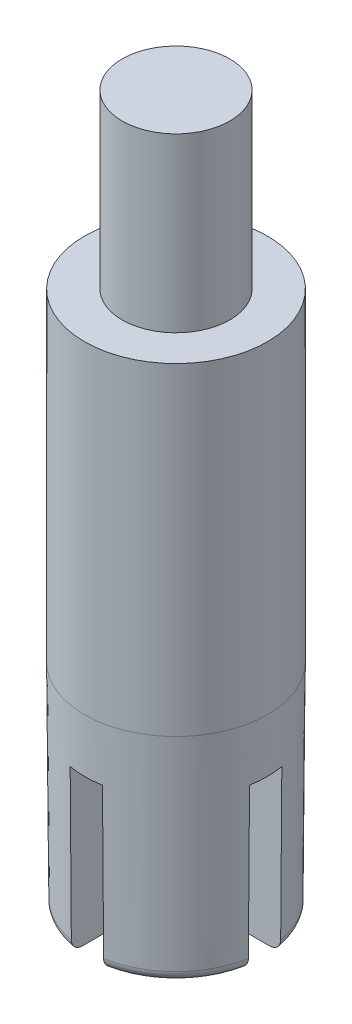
ISO-10303-21;
HEADER;
FILE_DESCRIPTION(('STEP AP214'),'2;1');
FILE_NAME('part.step','',(''),(''),'','','');
FILE_SCHEMA(('AUTOMOTIVE_DESIGN { 1 0 10303 214 1 1 1 1 }'));
ENDSEC;
DATA;
#1=APPLICATION_CONTEXT('core data for automotive mechanical design processes');
#2=APPLICATION_PROTOCOL_DEFINITION('international standard','automotive_design',2000,#1);
#3=PRODUCT_CONTEXT('',#1,'mechanical');
#4=PRODUCT('Part','Part','',(#3));
#5=PRODUCT_RELATED_PRODUCT_CATEGORY('part','',(#4));
#6=PRODUCT_DEFINITION_FORMATION('','',#4);
#7=PRODUCT_DEFINITION_CONTEXT('part definition',#1,'design');
#8=PRODUCT_DEFINITION('design','',#6,#7);
#9=PRODUCT_DEFINITION_SHAPE('','',#8);
#10=(LENGTH_UNIT() NAMED_UNIT(*) SI_UNIT(.MILLI.,.METRE.));
#11=(NAMED_UNIT(*) PLANE_ANGLE_UNIT() SI_UNIT($,.RADIAN.));
#12=(NAMED_UNIT(*) SI_UNIT($,.STERADIAN.) SOLID_ANGLE_UNIT());
#13=UNCERTAINTY_MEASURE_WITH_UNIT(LENGTH_MEASURE(1.E-05),#10,'distance_accuracy_value','');
#14=(GEOMETRIC_REPRESENTATION_CONTEXT(3) GLOBAL_UNCERTAINTY_ASSIGNED_CONTEXT((#13)) GLOBAL_UNIT_ASSIGNED_CONTEXT((#10,
#11,#12)) REPRESENTATION_CONTEXT('',''));
#15=CARTESIAN_POINT('',(0.,0.,0.));
#16=DIRECTION('',(0.,0.,1.));
#17=DIRECTION('',(1.,0.,0.));
#18=AXIS2_PLACEMENT_3D('',#15,#16,#17);
#19=CARTESIAN_POINT('',(-8.5,-66.,0.));
#20=DIRECTION('',(0.,-1.,0.));
#21=DIRECTION('',(0.,0.,-1.));
#22=AXIS2_PLACEMENT_3D('',#19,#20,#21);
#23=PLANE('',#22);
#24=DIRECTION('',(0.,0.,-1.));
#25=VECTOR('',#24,1.);
#26=CARTESIAN_POINT('',(-1.5,-66.,9.));
#27=LINE('',#26,#25);
#28=CARTESIAN_POINT('',(-1.5,-66.,7.20294331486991));
#29=VERTEX_POINT('',#28);
#30=CARTESIAN_POINT('',(-1.5,-66.,1.5));
#31=VERTEX_POINT('',#30);
#32=EDGE_CURVE('E341',#29,#31,#27,.T.);
#33=ORIENTED_EDGE('',*,*,#32,.F.);
#34=CARTESIAN_POINT('',(0.,-66.,0.));
#35=DIRECTION('',(0.,-1.,0.));
#36=DIRECTION('',(0.,0.,-1.));
#37=AXIS2_PLACEMENT_3D('',#34,#35,#36);
#38=CIRCLE('',#37,7.35747187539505);
#39=CARTESIAN_POINT('',(-7.20294331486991,-66.,1.5));
#40=VERTEX_POINT('',#39);
#41=EDGE_CURVE('E344',#29,#40,#38,.T.);
#42=ORIENTED_EDGE('',*,*,#41,.T.);
#43=DIRECTION('',(-1.,0.,0.));
#44=VECTOR('',#43,1.);
#45=CARTESIAN_POINT('',(9.,-66.,1.5));
#46=LINE('',#45,#44);
#47=EDGE_CURVE('E164',#31,#40,#46,.T.);
#48=ORIENTED_EDGE('',*,*,#47,.F.);
#49=EDGE_LOOP('',(#33,#42,#48));
#50=FACE_BOUND('',#49,.T.);
#51=ADVANCED_FACE('F16',(#50),#23,.T.);
#52=DIRECTION('',(1.,0.,0.));
#53=VECTOR('',#52,1.);
#54=CARTESIAN_POINT('',(9.,-66.,-1.5));
#55=LINE('',#54,#53);
#56=CARTESIAN_POINT('',(-7.20294331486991,-66.,-1.5));
#57=VERTEX_POINT('',#56);
#58=CARTESIAN_POINT('',(-1.5,-66.,-1.5));
#59=VERTEX_POINT('',#58);
#60=EDGE_CURVE('E161',#57,#59,#55,.T.);
#61=ORIENTED_EDGE('',*,*,#60,.F.);
#62=CARTESIAN_POINT('',(0.,-66.,0.));
#63=DIRECTION('',(0.,-1.,0.));
#64=DIRECTION('',(0.,0.,-1.));
#65=AXIS2_PLACEMENT_3D('',#62,#63,#64);
#66=CIRCLE('',#65,7.35747187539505);
#67=CARTESIAN_POINT('',(-1.5,-66.,-7.20294331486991));
#68=VERTEX_POINT('',#67);
#69=EDGE_CURVE('E254',#57,#68,#66,.T.);
#70=ORIENTED_EDGE('',*,*,#69,.T.);
#71=EDGE_CURVE('E426',#59,#68,#27,.T.);
#72=ORIENTED_EDGE('',*,*,#71,.F.);
#73=EDGE_LOOP('',(#61,#70,#72));
#74=FACE_BOUND('',#73,.T.);
#75=ADVANCED_FACE('F375',(#74),#23,.T.);
#76=CARTESIAN_POINT('',(9.,-51.,1.5));
#77=DIRECTION('',(0.,0.,1.));
#78=DIRECTION('',(1.,0.,0.));
#79=AXIS2_PLACEMENT_3D('',#76,#77,#78);
#80=PLANE('',#79);
#81=ORIENTED_EDGE('',*,*,#47,.T.);
#82=CARTESIAN_POINT('',(-7.20294331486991,-66.,1.5));
#83=CARTESIAN_POINT('',(-7.26111337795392,-66.0000452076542,1.5));
#84=CARTESIAN_POINT('',(-7.31928035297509,-65.9951377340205,1.5));
#85=CARTESIAN_POINT('',(-7.43398066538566,-65.9757080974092,1.5));
#86=CARTESIAN_POINT('',(-7.49051415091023,-65.961186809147,1.5));
#87=CARTESIAN_POINT('',(-7.60037486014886,-65.9228048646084,1.5));
#88=CARTESIAN_POINT('',(-7.6536994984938,-65.8989367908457,1.5));
#89=CARTESIAN_POINT('',(-7.75550067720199,-65.8424944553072,1.5));
#90=CARTESIAN_POINT('',(-7.80397914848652,-65.8099236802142,1.5));
#91=CARTESIAN_POINT('',(-7.89410785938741,-65.7373720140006,1.5));
#92=CARTESIAN_POINT('',(-7.93583076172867,-65.6974814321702,1.5));
#93=CARTESIAN_POINT('',(-8.01184875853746,-65.6111356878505,1.5));
#94=CARTESIAN_POINT('',(-8.04614248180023,-65.5646793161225,1.5));
#95=CARTESIAN_POINT('',(-8.10567289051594,-65.467423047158,1.5));
#96=CARTESIAN_POINT('',(-8.13105895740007,-65.4167144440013,1.5));
#97=CARTESIAN_POINT('',(-8.17279851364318,-65.311729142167,1.5));
#98=CARTESIAN_POINT('',(-8.18916004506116,-65.257455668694,1.5));
#99=CARTESIAN_POINT('',(-8.20748235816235,-65.1701961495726,1.5));
#100=CARTESIAN_POINT('',(-8.21260524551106,-65.1378419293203,1.5));
#101=CARTESIAN_POINT('',(-8.21960372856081,-65.0728342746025,1.5));
#102=CARTESIAN_POINT('',(-8.22148427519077,-65.0401813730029,1.5));
#103=CARTESIAN_POINT('',(-8.22173132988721,-65.0074997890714,1.5));
#104=B_SPLINE_CURVE_WITH_KNOTS('',3,(#82,#83,#84,#85,#86,#87,#88,#89,#90,#91,#92,#93,#94,#95,
#96,#97,#98,#99,#100,#101,#102,#103),.UNSPECIFIED.,.F.,.F.,(4,2,2,2,2,2,2,2,2,2,4),(0.,
0.174300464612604,0.348585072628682,0.523008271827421,0.697361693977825,0.869693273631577,
1.04205663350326,1.21137321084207,1.38053865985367,1.47866364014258,1.57663865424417),.UNSPECIFIED.);
#105=CARTESIAN_POINT('',(-8.22173132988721,-65.0074997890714,1.5));
#106=VERTEX_POINT('',#105);
#107=EDGE_CURVE('E30',#40,#106,#104,.T.);
#108=ORIENTED_EDGE('',*,*,#107,.T.);
#109=CARTESIAN_POINT('',(-8.10174468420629,-80.7421795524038,1.5));
#110=CARTESIAN_POINT('',(-8.14395734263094,-75.2078775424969,1.5));
#111=CARTESIAN_POINT('',(-8.18615910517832,-69.6735754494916,1.5));
#112=CARTESIAN_POINT('',(-8.27054175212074,-58.6049711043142,1.5));
#113=CARTESIAN_POINT('',(-8.31272263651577,-53.0706688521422,1.5));
#114=CARTESIAN_POINT('',(-8.46127619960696,-33.575227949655,1.5));
#115=CARTESIAN_POINT('',(-8.56759533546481,-19.614088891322,1.5));
#116=CARTESIAN_POINT('',(-8.67385827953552,-5.65294940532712,1.5));
#117=B_SPLINE_CURVE_WITH_KNOTS('',3,(#109,#110,#111,#112,#113,#114,#115,#116),.UNSPECIFIED.,.F.,
.F.,(4,2,2,4),(0.,16.6033889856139,33.2067779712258,75.0914096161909),.UNSPECIFIED.);
#118=CARTESIAN_POINT('',(-8.32849963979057,-51.,1.5));
#119=VERTEX_POINT('',#118);
#120=EDGE_CURVE('E322',#106,#119,#117,.T.);
#121=ORIENTED_EDGE('',*,*,#120,.T.);
#122=DIRECTION('',(-1.,0.,0.));
#123=VECTOR('',#122,1.);
#124=CARTESIAN_POINT('',(9.,-51.,1.5));
#125=LINE('',#124,#123);
#126=CARTESIAN_POINT('',(-1.5,-51.,1.5));
#127=VERTEX_POINT('',#126);
#128=EDGE_CURVE('E300',#127,#119,#125,.T.);
#129=ORIENTED_EDGE('',*,*,#128,.F.);
#130=DIRECTION('',(0.,-1.,0.));
#131=VECTOR('',#130,1.);
#132=CARTESIAN_POINT('',(-1.5,-51.,1.5));
#133=LINE('',#132,#131);
#134=EDGE_CURVE('E284',#127,#31,#133,.T.);
#135=ORIENTED_EDGE('',*,*,#134,.T.);
#136=EDGE_LOOP('',(#81,#108,#121,#129,#135));
#137=FACE_BOUND('',#136,.T.);
#138=ADVANCED_FACE('F332',(#137),#80,.F.);
#139=CARTESIAN_POINT('',(9.,-51.,-1.5));
#140=DIRECTION('',(0.,0.,-1.));
#141=DIRECTION('',(-1.,0.,0.));
#142=AXIS2_PLACEMENT_3D('',#139,#140,#141);
#143=PLANE('',#142);
#144=CARTESIAN_POINT('',(-8.10174468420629,-80.7421795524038,-1.5));
#145=CARTESIAN_POINT('',(-8.14395734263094,-75.2078775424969,-1.5));
#146=CARTESIAN_POINT('',(-8.18615910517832,-69.6735754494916,-1.5));
#147=CARTESIAN_POINT('',(-8.27054175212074,-58.6049711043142,-1.5));
#148=CARTESIAN_POINT('',(-8.31272263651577,-53.0706688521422,-1.5));
#149=CARTESIAN_POINT('',(-8.46127619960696,-33.575227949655,-1.5));
#150=CARTESIAN_POINT('',(-8.56759533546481,-19.614088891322,-1.5));
#151=CARTESIAN_POINT('',(-8.67385827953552,-5.65294940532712,-1.5));
#152=B_SPLINE_CURVE_WITH_KNOTS('',3,(#144,#145,#146,#147,#148,#149,#150,#151),.UNSPECIFIED.,.F.,
.F.,(4,2,2,4),(0.,16.6033889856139,33.2067779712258,75.0914096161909),.UNSPECIFIED.);
#153=CARTESIAN_POINT('',(-8.32849963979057,-51.,-1.5));
#154=VERTEX_POINT('',#153);
#155=CARTESIAN_POINT('',(-8.22173132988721,-65.0074997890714,-1.5));
#156=VERTEX_POINT('',#155);
#157=EDGE_CURVE('E221',#154,#156,#152,.F.);
#158=ORIENTED_EDGE('',*,*,#157,.T.);
#159=CARTESIAN_POINT('',(-8.22173132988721,-65.0074997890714,-1.5));
#160=CARTESIAN_POINT('',(-8.2215194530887,-65.0352946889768,-1.5));
#161=CARTESIAN_POINT('',(-8.22012887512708,-65.0630671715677,-1.5));
#162=CARTESIAN_POINT('',(-8.21500576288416,-65.1183930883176,-1.5));
#163=CARTESIAN_POINT('',(-8.21127341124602,-65.1459465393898,-1.5));
#164=CARTESIAN_POINT('',(-8.19660681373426,-65.2279102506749,-1.5));
#165=CARTESIAN_POINT('',(-8.18220200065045,-65.2817404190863,-1.5));
#166=CARTESIAN_POINT('',(-8.14457232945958,-65.3862106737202,-1.5));
#167=CARTESIAN_POINT('',(-8.12134452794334,-65.4368496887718,-1.5));
#168=CARTESIAN_POINT('',(-8.06677238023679,-65.5335470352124,-1.5));
#169=CARTESIAN_POINT('',(-8.03542852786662,-65.5796056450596,-1.5));
#170=CARTESIAN_POINT('',(-7.96531932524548,-65.6661831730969,-1.5));
#171=CARTESIAN_POINT('',(-7.9265059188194,-65.7066631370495,-1.5));
#172=CARTESIAN_POINT('',(-7.84271979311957,-65.7806608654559,-1.5));
#173=CARTESIAN_POINT('',(-7.79774572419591,-65.8141771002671,-1.5));
#174=CARTESIAN_POINT('',(-7.70217115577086,-65.8738601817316,-1.5));
#175=CARTESIAN_POINT('',(-7.65149285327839,-65.8999022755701,-1.5));
#176=CARTESIAN_POINT('',(-7.54654218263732,-65.9432679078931,-1.5));
#177=CARTESIAN_POINT('',(-7.49227103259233,-65.9605943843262,-1.5));
#178=CARTESIAN_POINT('',(-7.39860776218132,-65.9822237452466,-1.5));
#179=CARTESIAN_POINT('',(-7.35974344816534,-65.9888893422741,-1.5));
#180=CARTESIAN_POINT('',(-7.28157144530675,-65.9977766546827,-1.5));
#181=CARTESIAN_POINT('',(-7.24226454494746,-66.0000053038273,-1.5));
#182=CARTESIAN_POINT('',(-7.20294331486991,-66.,-1.5));
#183=B_SPLINE_CURVE_WITH_KNOTS('',3,(#159,#160,#161,#162,#163,#164,#165,#166,#167,#168,#169,
#170,#171,#172,#173,#174,#175,#176,#177,#178,#179,#180,#181,#182),.UNSPECIFIED.,.F.,.F.,(4,2,2,
2,2,2,2,2,2,2,2,4),(0.,0.0833355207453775,0.166664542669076,0.332977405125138,0.499345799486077,
0.66570407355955,0.833170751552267,1.0006741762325,1.17082944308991,1.34092731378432,
1.45898399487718,1.57685603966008),.UNSPECIFIED.);
#184=EDGE_CURVE('E409',#156,#57,#183,.T.);
#185=ORIENTED_EDGE('',*,*,#184,.T.);
#186=ORIENTED_EDGE('',*,*,#60,.T.);
#187=DIRECTION('',(0.,1.,0.));
#188=VECTOR('',#187,1.);
#189=CARTESIAN_POINT('',(-1.5,-51.,-1.5));
#190=LINE('',#189,#188);
#191=CARTESIAN_POINT('',(-1.5,-51.,-1.5));
#192=VERTEX_POINT('',#191);
#193=EDGE_CURVE('E281',#59,#192,#190,.T.);
#194=ORIENTED_EDGE('',*,*,#193,.T.);
#195=DIRECTION('',(1.,0.,0.));
#196=VECTOR('',#195,1.);
#197=CARTESIAN_POINT('',(9.,-51.,-1.5));
#198=LINE('',#197,#196);
#199=EDGE_CURVE('E298',#154,#192,#198,.T.);
#200=ORIENTED_EDGE('',*,*,#199,.F.);
#201=EDGE_LOOP('',(#158,#185,#186,#194,#200));
#202=FACE_BOUND('',#201,.T.);
#203=ADVANCED_FACE('F213',(#202),#143,.F.);
#204=CARTESIAN_POINT('',(7.20294331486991,-66.,1.5));
#205=VERTEX_POINT('',#204);
#206=CARTESIAN_POINT('',(1.5,-66.,1.5));
#207=VERTEX_POINT('',#206);
#208=EDGE_CURVE('E171',#205,#207,#46,.T.);
#209=ORIENTED_EDGE('',*,*,#208,.F.);
#210=CARTESIAN_POINT('',(0.,-66.,0.));
#211=DIRECTION('',(0.,-1.,0.));
#212=DIRECTION('',(0.,0.,-1.));
#213=AXIS2_PLACEMENT_3D('',#210,#211,#212);
#214=CIRCLE('',#213,7.35747187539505);
#215=CARTESIAN_POINT('',(1.5,-66.,7.20294331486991));
#216=VERTEX_POINT('',#215);
#217=EDGE_CURVE('E405',#205,#216,#214,.T.);
#218=ORIENTED_EDGE('',*,*,#217,.T.);
#219=DIRECTION('',(0.,0.,1.));
#220=VECTOR('',#219,1.);
#221=CARTESIAN_POINT('',(1.5,-66.,9.));
#222=LINE('',#221,#220);
#223=EDGE_CURVE('E148',#207,#216,#222,.T.);
#224=ORIENTED_EDGE('',*,*,#223,.F.);
#225=EDGE_LOOP('',(#209,#218,#224));
#226=FACE_BOUND('',#225,.T.);
#227=ADVANCED_FACE('F381',(#226),#23,.T.);
#228=CARTESIAN_POINT('',(0.,0.,0.));
#229=DIRECTION('',(0.,1.,0.));
#230=DIRECTION('',(0.,0.,1.));
#231=AXIS2_PLACEMENT_3D('',#228,#229,#230);
#232=PLANE('',#231);
#233=CARTESIAN_POINT('',(0.,0.,0.));
#234=DIRECTION('',(0.,1.,0.));
#235=DIRECTION('',(0.,0.,1.));
#236=AXIS2_PLACEMENT_3D('',#233,#234,#235);
#237=CIRCLE('',#236,5.);
#238=CARTESIAN_POINT('',(0.,0.,5.));
#239=VERTEX_POINT('',#238);
#240=EDGE_CURVE('E179',#239,#239,#237,.T.);
#241=ORIENTED_EDGE('',*,*,#240,.T.);
#242=EDGE_LOOP('',(#241));
#243=FACE_BOUND('',#242,.T.);
#244=ADVANCED_FACE('F392',(#243),#232,.T.);
#245=CARTESIAN_POINT('',(0.,0.,0.));
#246=DIRECTION('',(0.,1.,0.));
#247=DIRECTION('',(0.,0.,1.));
#248=AXIS2_PLACEMENT_3D('',#245,#246,#247);
#249=CYLINDRICAL_SURFACE('',#248,5.);
#250=CARTESIAN_POINT('',(0.,-16.,0.));
#251=DIRECTION('',(0.,1.,0.));
#252=DIRECTION('',(0.,0.,1.));
#253=AXIS2_PLACEMENT_3D('',#250,#251,#252);
#254=CIRCLE('',#253,5.);
#255=CARTESIAN_POINT('',(0.,-16.,5.));
#256=VERTEX_POINT('',#255);
#257=EDGE_CURVE('E176',#256,#256,#254,.T.);
#258=ORIENTED_EDGE('',*,*,#257,.T.);
#259=EDGE_LOOP('',(#258));
#260=FACE_BOUND('',#259,.T.);
#261=ORIENTED_EDGE('',*,*,#240,.F.);
#262=EDGE_LOOP('',(#261));
#263=FACE_BOUND('',#262,.T.);
#264=ADVANCED_FACE('F399',(#260,#263),#249,.T.);
#265=CARTESIAN_POINT('',(-5.,-16.,0.));
#266=DIRECTION('',(0.,1.,0.));
#267=DIRECTION('',(0.,0.,1.));
#268=AXIS2_PLACEMENT_3D('',#265,#266,#267);
#269=PLANE('',#268);
#270=CARTESIAN_POINT('',(0.,-16.,0.));
#271=DIRECTION('',(0.,1.,0.));
#272=DIRECTION('',(0.,0.,1.));
#273=AXIS2_PLACEMENT_3D('',#270,#271,#272);
#274=CIRCLE('',#273,8.5);
#275=CARTESIAN_POINT('',(0.,-16.,8.5));
#276=VERTEX_POINT('',#275);
#277=EDGE_CURVE('E173',#276,#276,#274,.T.);
#278=ORIENTED_EDGE('',*,*,#277,.T.);
#279=EDGE_LOOP('',(#278));
#280=FACE_BOUND('',#279,.T.);
#281=ORIENTED_EDGE('',*,*,#257,.F.);
#282=EDGE_LOOP('',(#281));
#283=FACE_BOUND('',#282,.T.);
#284=ADVANCED_FACE('F389',(#280,#283),#269,.T.);
#285=CARTESIAN_POINT('',(0.,0.,0.));
#286=DIRECTION('',(0.,1.,0.));
#287=DIRECTION('',(0.,0.,1.));
#288=AXIS2_PLACEMENT_3D('',#285,#286,#287);
#289=CYLINDRICAL_SURFACE('',#288,8.5);
#290=CARTESIAN_POINT('',(0.,-45.9999999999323,0.));
#291=DIRECTION('',(0.,-1.,0.));
#292=DIRECTION('',(0.,0.,-1.));
#293=AXIS2_PLACEMENT_3D('',#290,#291,#292);
#294=CIRCLE('',#293,8.5);
#295=CARTESIAN_POINT('',(0.,-45.9999999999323,-8.5));
#296=VERTEX_POINT('',#295);
#297=EDGE_CURVE('E182',#296,#296,#294,.F.);
#298=ORIENTED_EDGE('',*,*,#297,.T.);
#299=EDGE_LOOP('',(#298));
#300=FACE_BOUND('',#299,.T.);
#301=ORIENTED_EDGE('',*,*,#277,.F.);
#302=EDGE_LOOP('',(#301));
#303=FACE_BOUND('',#302,.T.);
#304=ADVANCED_FACE('F383',(#300,#303),#289,.T.);
#305=CARTESIAN_POINT('',(1.5,-66.,-7.20294331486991));
#306=VERTEX_POINT('',#305);
#307=CARTESIAN_POINT('',(1.5,-66.,-1.5));
#308=VERTEX_POINT('',#307);
#309=EDGE_CURVE('E134',#306,#308,#222,.T.);
#310=ORIENTED_EDGE('',*,*,#309,.F.);
#311=CARTESIAN_POINT('',(0.,-66.,0.));
#312=DIRECTION('',(0.,-1.,0.));
#313=DIRECTION('',(0.,0.,-1.));
#314=AXIS2_PLACEMENT_3D('',#311,#312,#313);
#315=CIRCLE('',#314,7.35747187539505);
#316=CARTESIAN_POINT('',(7.20294331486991,-66.,-1.5));
#317=VERTEX_POINT('',#316);
#318=EDGE_CURVE('E160',#306,#317,#315,.T.);
#319=ORIENTED_EDGE('',*,*,#318,.T.);
#320=EDGE_CURVE('E153',#308,#317,#55,.T.);
#321=ORIENTED_EDGE('',*,*,#320,.F.);
#322=EDGE_LOOP('',(#310,#319,#321));
#323=FACE_BOUND('',#322,.T.);
#324=ADVANCED_FACE('F159',(#323),#23,.T.);
#325=CARTESIAN_POINT('',(0.,-45.9999999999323,0.));
#326=DIRECTION('',(0.,1.,0.));
#327=DIRECTION('',(0.,0.,1.));
#328=AXIS2_PLACEMENT_3D('',#325,#326,#327);
#329=CONICAL_SURFACE('',#328,8.5,0.0074998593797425);
#330=CARTESIAN_POINT('',(8.10174468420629,-80.7421795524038,-1.5));
#331=CARTESIAN_POINT('',(8.14395734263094,-75.2078775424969,-1.5));
#332=CARTESIAN_POINT('',(8.18615910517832,-69.6735754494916,-1.5));
#333=CARTESIAN_POINT('',(8.27054175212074,-58.6049711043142,-1.5));
#334=CARTESIAN_POINT('',(8.31272263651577,-53.0706688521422,-1.5));
#335=CARTESIAN_POINT('',(8.46127619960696,-33.575227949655,-1.5));
#336=CARTESIAN_POINT('',(8.56759533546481,-19.614088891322,-1.5));
#337=CARTESIAN_POINT('',(8.67385827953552,-5.65294940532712,-1.5));
#338=B_SPLINE_CURVE_WITH_KNOTS('',3,(#330,#331,#332,#333,#334,#335,#336,#337),.UNSPECIFIED.,.F.,
.F.,(4,2,2,4),(0.,16.6033889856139,33.2067779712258,75.0914096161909),.UNSPECIFIED.);
#339=CARTESIAN_POINT('',(8.22173132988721,-65.0074997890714,-1.5));
#340=VERTEX_POINT('',#339);
#341=CARTESIAN_POINT('',(8.32849963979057,-51.,-1.5));
#342=VERTEX_POINT('',#341);
#343=EDGE_CURVE('E188',#340,#342,#338,.T.);
#344=ORIENTED_EDGE('',*,*,#343,.F.);
#345=CARTESIAN_POINT('',(0.,-65.0074997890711,0.));
#346=DIRECTION('',(0.,-1.,0.));
#347=DIRECTION('',(0.,0.,-1.));
#348=AXIS2_PLACEMENT_3D('',#345,#346,#347);
#349=CIRCLE('',#348,8.35744375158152);
#350=CARTESIAN_POINT('',(1.5,-65.0074997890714,-8.22173132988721));
#351=VERTEX_POINT('',#350);
#352=EDGE_CURVE('E255',#340,#351,#349,.F.);
#353=ORIENTED_EDGE('',*,*,#352,.T.);
#354=CARTESIAN_POINT('',(1.5,-80.7421795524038,-8.10174468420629));
#355=CARTESIAN_POINT('',(1.5,-75.2078775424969,-8.14395734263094));
#356=CARTESIAN_POINT('',(1.5,-69.6735754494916,-8.18615910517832));
#357=CARTESIAN_POINT('',(1.5,-58.6049711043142,-8.27054175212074));
#358=CARTESIAN_POINT('',(1.5,-53.0706688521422,-8.31272263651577));
#359=CARTESIAN_POINT('',(1.5,-33.575227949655,-8.46127619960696));
#360=CARTESIAN_POINT('',(1.5,-19.614088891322,-8.56759533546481));
#361=CARTESIAN_POINT('',(1.5,-5.65294940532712,-8.67385827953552));
#362=B_SPLINE_CURVE_WITH_KNOTS('',3,(#354,#355,#356,#357,#358,#359,#360,#361),.UNSPECIFIED.,.F.,
.F.,(4,2,2,4),(0.,16.6033889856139,33.2067779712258,75.0914096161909),.UNSPECIFIED.);
#363=CARTESIAN_POINT('',(1.5,-51.,-8.32849963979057));
#364=VERTEX_POINT('',#363);
#365=EDGE_CURVE('E275',#364,#351,#362,.F.);
#366=ORIENTED_EDGE('',*,*,#365,.F.);
#367=CARTESIAN_POINT('',(0.,-51.,0.));
#368=DIRECTION('',(0.,1.,0.));
#369=DIRECTION('',(0.,0.,1.));
#370=AXIS2_PLACEMENT_3D('',#367,#368,#369);
#371=CIRCLE('',#370,8.4624999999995);
#372=CARTESIAN_POINT('',(-1.5,-51.,-8.32849963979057));
#373=VERTEX_POINT('',#372);
#374=EDGE_CURVE('E162',#373,#364,#371,.F.);
#375=ORIENTED_EDGE('',*,*,#374,.F.);
#376=CARTESIAN_POINT('',(-1.5,-80.7421795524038,-8.10174468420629));
#377=CARTESIAN_POINT('',(-1.5,-75.2078775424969,-8.14395734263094));
#378=CARTESIAN_POINT('',(-1.5,-69.6735754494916,-8.18615910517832));
#379=CARTESIAN_POINT('',(-1.5,-58.6049711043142,-8.27054175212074));
#380=CARTESIAN_POINT('',(-1.5,-53.0706688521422,-8.31272263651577));
#381=CARTESIAN_POINT('',(-1.5,-33.575227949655,-8.46127619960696));
#382=CARTESIAN_POINT('',(-1.5,-19.614088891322,-8.56759533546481));
#383=CARTESIAN_POINT('',(-1.5,-5.65294940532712,-8.67385827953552));
#384=B_SPLINE_CURVE_WITH_KNOTS('',3,(#376,#377,#378,#379,#380,#381,#382,#383),.UNSPECIFIED.,.F.,
.F.,(4,2,2,4),(0.,16.6033889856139,33.2067779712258,75.0914096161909),.UNSPECIFIED.);
#385=CARTESIAN_POINT('',(-1.5,-65.0074997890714,-8.22173132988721));
#386=VERTEX_POINT('',#385);
#387=EDGE_CURVE('E293',#386,#373,#384,.T.);
#388=ORIENTED_EDGE('',*,*,#387,.F.);
#389=CARTESIAN_POINT('',(0.,-65.0074997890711,0.));
#390=DIRECTION('',(0.,-1.,0.));
#391=DIRECTION('',(0.,0.,-1.));
#392=AXIS2_PLACEMENT_3D('',#389,#390,#391);
#393=CIRCLE('',#392,8.35744375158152);
#394=EDGE_CURVE('E431',#386,#156,#393,.F.);
#395=ORIENTED_EDGE('',*,*,#394,.T.);
#396=ORIENTED_EDGE('',*,*,#157,.F.);
#397=CARTESIAN_POINT('',(0.,-51.,0.));
#398=DIRECTION('',(0.,-1.,0.));
#399=DIRECTION('',(0.,0.,-1.));
#400=AXIS2_PLACEMENT_3D('',#397,#398,#399);
#401=CIRCLE('',#400,8.4624999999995);
#402=EDGE_CURVE('E189',#154,#119,#401,.F.);
#403=ORIENTED_EDGE('',*,*,#402,.T.);
#404=ORIENTED_EDGE('',*,*,#120,.F.);
#405=CARTESIAN_POINT('',(0.,-65.0074997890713,0.));
#406=DIRECTION('',(0.,-1.,0.));
#407=DIRECTION('',(0.,0.,-1.));
#408=AXIS2_PLACEMENT_3D('',#405,#406,#407);
#409=CIRCLE('',#408,8.35744375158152);
#410=CARTESIAN_POINT('',(-1.5,-65.0074997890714,8.22173132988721));
#411=VERTEX_POINT('',#410);
#412=EDGE_CURVE('E235',#106,#411,#409,.F.);
#413=ORIENTED_EDGE('',*,*,#412,.T.);
#414=CARTESIAN_POINT('',(-1.5,-80.7421795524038,8.10174468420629));
#415=CARTESIAN_POINT('',(-1.5,-75.2078775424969,8.14395734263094));
#416=CARTESIAN_POINT('',(-1.5,-69.6735754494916,8.18615910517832));
#417=CARTESIAN_POINT('',(-1.5,-58.6049711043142,8.27054175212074));
#418=CARTESIAN_POINT('',(-1.5,-53.0706688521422,8.31272263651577));
#419=CARTESIAN_POINT('',(-1.5,-33.575227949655,8.46127619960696));
#420=CARTESIAN_POINT('',(-1.5,-19.614088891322,8.56759533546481));
#421=CARTESIAN_POINT('',(-1.5,-5.65294940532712,8.67385827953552));
#422=B_SPLINE_CURVE_WITH_KNOTS('',3,(#414,#415,#416,#417,#418,#419,#420,#421),.UNSPECIFIED.,.F.,
.F.,(4,2,2,4),(0.,16.6033889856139,33.2067779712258,75.0914096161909),.UNSPECIFIED.);
#423=CARTESIAN_POINT('',(-1.5,-51.,8.32849963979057));
#424=VERTEX_POINT('',#423);
#425=EDGE_CURVE('E287',#424,#411,#422,.F.);
#426=ORIENTED_EDGE('',*,*,#425,.F.);
#427=CARTESIAN_POINT('',(1.5,-51.,8.32849963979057));
#428=VERTEX_POINT('',#427);
#429=EDGE_CURVE('E165',#428,#424,#371,.F.);
#430=ORIENTED_EDGE('',*,*,#429,.F.);
#431=CARTESIAN_POINT('',(1.5,-80.7421795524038,8.10174468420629));
#432=CARTESIAN_POINT('',(1.5,-75.2078775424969,8.14395734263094));
#433=CARTESIAN_POINT('',(1.5,-69.6735754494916,8.18615910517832));
#434=CARTESIAN_POINT('',(1.5,-58.6049711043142,8.27054175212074));
#435=CARTESIAN_POINT('',(1.5,-53.0706688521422,8.31272263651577));
#436=CARTESIAN_POINT('',(1.5,-33.575227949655,8.46127619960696));
#437=CARTESIAN_POINT('',(1.5,-19.614088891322,8.56759533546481));
#438=CARTESIAN_POINT('',(1.5,-5.65294940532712,8.67385827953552));
#439=B_SPLINE_CURVE_WITH_KNOTS('',3,(#431,#432,#433,#434,#435,#436,#437,#438),.UNSPECIFIED.,.F.,
.F.,(4,2,2,4),(0.,16.6033889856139,33.2067779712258,75.0914096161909),.UNSPECIFIED.);
#440=CARTESIAN_POINT('',(1.5,-65.0074997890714,8.22173132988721));
#441=VERTEX_POINT('',#440);
#442=EDGE_CURVE('E266',#441,#428,#439,.T.);
#443=ORIENTED_EDGE('',*,*,#442,.F.);
#444=CARTESIAN_POINT('',(0.,-65.0074997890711,0.));
#445=DIRECTION('',(0.,-1.,0.));
#446=DIRECTION('',(0.,0.,-1.));
#447=AXIS2_PLACEMENT_3D('',#444,#445,#446);
#448=CIRCLE('',#447,8.35744375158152);
#449=CARTESIAN_POINT('',(8.22173132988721,-65.0074997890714,1.5));
#450=VERTEX_POINT('',#449);
#451=EDGE_CURVE('E315',#441,#450,#448,.F.);
#452=ORIENTED_EDGE('',*,*,#451,.T.);
#453=CARTESIAN_POINT('',(8.10174468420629,-80.7421795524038,1.5));
#454=CARTESIAN_POINT('',(8.14395734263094,-75.2078775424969,1.5));
#455=CARTESIAN_POINT('',(8.18615910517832,-69.6735754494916,1.5));
#456=CARTESIAN_POINT('',(8.27054175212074,-58.6049711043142,1.5));
#457=CARTESIAN_POINT('',(8.31272263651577,-53.0706688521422,1.5));
#458=CARTESIAN_POINT('',(8.46127619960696,-33.575227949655,1.5));
#459=CARTESIAN_POINT('',(8.56759533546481,-19.614088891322,1.5));
#460=CARTESIAN_POINT('',(8.67385827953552,-5.65294940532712,1.5));
#461=B_SPLINE_CURVE_WITH_KNOTS('',3,(#453,#454,#455,#456,#457,#458,#459,#460),.UNSPECIFIED.,.F.,
.F.,(4,2,2,4),(0.,16.6033889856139,33.2067779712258,75.0914096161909),.UNSPECIFIED.);
#462=CARTESIAN_POINT('',(8.32849963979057,-51.,1.5));
#463=VERTEX_POINT('',#462);
#464=EDGE_CURVE('E197',#463,#450,#461,.F.);
#465=ORIENTED_EDGE('',*,*,#464,.F.);
#466=EDGE_CURVE('E185',#463,#342,#401,.F.);
#467=ORIENTED_EDGE('',*,*,#466,.T.);
#468=EDGE_LOOP('',(#344,#353,#366,#375,#388,#395,#396,#403,#404,#413,#426,#430,#443,#452,#465,#467));
#469=FACE_BOUND('',#468,.T.);
#470=ORIENTED_EDGE('',*,*,#297,.F.);
#471=EDGE_LOOP('',(#470));
#472=FACE_BOUND('',#471,.T.);
#473=ADVANCED_FACE('F204',(#469,#472),#329,.T.);
#474=ORIENTED_EDGE('',*,*,#464,.T.);
#475=CARTESIAN_POINT('',(8.22173132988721,-65.0074997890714,1.5));
#476=CARTESIAN_POINT('',(8.22151945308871,-65.0352946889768,1.5));
#477=CARTESIAN_POINT('',(8.22012887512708,-65.0630671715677,1.5));
#478=CARTESIAN_POINT('',(8.21500576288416,-65.1183930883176,1.5));
#479=CARTESIAN_POINT('',(8.21127341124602,-65.1459465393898,1.5));
#480=CARTESIAN_POINT('',(8.19660681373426,-65.2279102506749,1.5));
#481=CARTESIAN_POINT('',(8.18220200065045,-65.2817404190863,1.5));
#482=CARTESIAN_POINT('',(8.14457232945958,-65.3862106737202,1.5));
#483=CARTESIAN_POINT('',(8.12134452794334,-65.4368496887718,1.5));
#484=CARTESIAN_POINT('',(8.06677238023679,-65.5335470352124,1.5));
#485=CARTESIAN_POINT('',(8.03542852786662,-65.5796056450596,1.5));
#486=CARTESIAN_POINT('',(7.96531932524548,-65.6661831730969,1.5));
#487=CARTESIAN_POINT('',(7.9265059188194,-65.7066631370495,1.5));
#488=CARTESIAN_POINT('',(7.84271979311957,-65.7806608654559,1.5));
#489=CARTESIAN_POINT('',(7.79774572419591,-65.8141771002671,1.5));
#490=CARTESIAN_POINT('',(7.70217115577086,-65.8738601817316,1.5));
#491=CARTESIAN_POINT('',(7.65149285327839,-65.8999022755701,1.5));
#492=CARTESIAN_POINT('',(7.54654218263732,-65.9432679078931,1.5));
#493=CARTESIAN_POINT('',(7.49227103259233,-65.9605943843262,1.5));
#494=CARTESIAN_POINT('',(7.39860776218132,-65.9822237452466,1.5));
#495=CARTESIAN_POINT('',(7.35974344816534,-65.9888893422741,1.5));
#496=CARTESIAN_POINT('',(7.28157144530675,-65.9977766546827,1.5));
#497=CARTESIAN_POINT('',(7.24226454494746,-66.0000053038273,1.5));
#498=CARTESIAN_POINT('',(7.20294331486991,-66.,1.5));
#499=B_SPLINE_CURVE_WITH_KNOTS('',3,(#475,#476,#477,#478,#479,#480,#481,#482,#483,#484,#485,
#486,#487,#488,#489,#490,#491,#492,#493,#494,#495,#496,#497,#498),.UNSPECIFIED.,.F.,.F.,(4,2,2,
2,2,2,2,2,2,2,2,4),(0.,0.0833355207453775,0.166664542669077,0.332977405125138,0.499345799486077,
0.665704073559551,0.833170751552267,1.0006741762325,1.17082944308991,1.34092731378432,
1.45898399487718,1.57685603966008),.UNSPECIFIED.);
#500=EDGE_CURVE('E345',#450,#205,#499,.T.);
#501=ORIENTED_EDGE('',*,*,#500,.T.);
#502=ORIENTED_EDGE('',*,*,#208,.T.);
#503=DIRECTION('',(0.,1.,0.));
#504=VECTOR('',#503,1.);
#505=CARTESIAN_POINT('',(1.5,-51.,1.5));
#506=LINE('',#505,#504);
#507=CARTESIAN_POINT('',(1.5,-51.,1.5));
#508=VERTEX_POINT('',#507);
#509=EDGE_CURVE('E156',#207,#508,#506,.T.);
#510=ORIENTED_EDGE('',*,*,#509,.T.);
#511=EDGE_CURVE('E169',#463,#508,#125,.T.);
#512=ORIENTED_EDGE('',*,*,#511,.F.);
#513=EDGE_LOOP('',(#474,#501,#502,#510,#512));
#514=FACE_BOUND('',#513,.T.);
#515=ADVANCED_FACE('F212',(#514),#80,.F.);
#516=ORIENTED_EDGE('',*,*,#320,.T.);
#517=CARTESIAN_POINT('',(7.20294331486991,-66.,-1.5));
#518=CARTESIAN_POINT('',(7.26111337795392,-66.0000452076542,-1.5));
#519=CARTESIAN_POINT('',(7.31928035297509,-65.9951377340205,-1.5));
#520=CARTESIAN_POINT('',(7.43398066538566,-65.9757080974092,-1.5));
#521=CARTESIAN_POINT('',(7.49051415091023,-65.961186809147,-1.5));
#522=CARTESIAN_POINT('',(7.60037486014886,-65.9228048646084,-1.5));
#523=CARTESIAN_POINT('',(7.6536994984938,-65.8989367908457,-1.5));
#524=CARTESIAN_POINT('',(7.75550067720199,-65.8424944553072,-1.5));
#525=CARTESIAN_POINT('',(7.80397914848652,-65.8099236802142,-1.5));
#526=CARTESIAN_POINT('',(7.89410785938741,-65.7373720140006,-1.5));
#527=CARTESIAN_POINT('',(7.93583076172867,-65.6974814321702,-1.5));
#528=CARTESIAN_POINT('',(8.01184875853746,-65.6111356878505,-1.5));
#529=CARTESIAN_POINT('',(8.04614248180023,-65.5646793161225,-1.5));
#530=CARTESIAN_POINT('',(8.10567289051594,-65.467423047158,-1.5));
#531=CARTESIAN_POINT('',(8.13105895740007,-65.4167144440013,-1.5));
#532=CARTESIAN_POINT('',(8.17279851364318,-65.311729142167,-1.5));
#533=CARTESIAN_POINT('',(8.18916004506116,-65.257455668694,-1.5));
#534=CARTESIAN_POINT('',(8.20748235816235,-65.1701961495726,-1.5));
#535=CARTESIAN_POINT('',(8.21260524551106,-65.1378419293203,-1.5));
#536=CARTESIAN_POINT('',(8.21960372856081,-65.0728342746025,-1.5));
#537=CARTESIAN_POINT('',(8.22148427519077,-65.0401813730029,-1.5));
#538=CARTESIAN_POINT('',(8.22173132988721,-65.0074997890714,-1.5));
#539=B_SPLINE_CURVE_WITH_KNOTS('',3,(#517,#518,#519,#520,#521,#522,#523,#524,#525,#526,#527,
#528,#529,#530,#531,#532,#533,#534,#535,#536,#537,#538),.UNSPECIFIED.,.F.,.F.,(4,2,2,2,2,2,2,2,
2,2,4),(0.,0.174300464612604,0.348585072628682,0.523008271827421,0.697361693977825,
0.869693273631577,1.04205663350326,1.21137321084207,1.38053865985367,1.47866364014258,
1.57663865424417),.UNSPECIFIED.);
#540=EDGE_CURVE('E228',#317,#340,#539,.T.);
#541=ORIENTED_EDGE('',*,*,#540,.T.);
#542=ORIENTED_EDGE('',*,*,#343,.T.);
#543=CARTESIAN_POINT('',(1.5,-51.,-1.5));
#544=VERTEX_POINT('',#543);
#545=EDGE_CURVE('E155',#544,#342,#198,.T.);
#546=ORIENTED_EDGE('',*,*,#545,.F.);
#547=DIRECTION('',(0.,-1.,0.));
#548=VECTOR('',#547,1.);
#549=CARTESIAN_POINT('',(1.5,-51.,-1.5));
#550=LINE('',#549,#548);
#551=EDGE_CURVE('E139',#544,#308,#550,.T.);
#552=ORIENTED_EDGE('',*,*,#551,.T.);
#553=EDGE_LOOP('',(#516,#541,#542,#546,#552));
#554=FACE_BOUND('',#553,.T.);
#555=ADVANCED_FACE('F152',(#554),#143,.F.);
#556=CARTESIAN_POINT('',(0.,-51.,0.));
#557=DIRECTION('',(0.,-1.,0.));
#558=DIRECTION('',(0.,0.,-1.));
#559=AXIS2_PLACEMENT_3D('',#556,#557,#558);
#560=PLANE('',#559);
#561=ORIENTED_EDGE('',*,*,#511,.T.);
#562=DIRECTION('',(0.,0.,1.));
#563=VECTOR('',#562,1.);
#564=CARTESIAN_POINT('',(1.5,-51.,9.));
#565=LINE('',#564,#563);
#566=EDGE_CURVE('E339',#508,#428,#565,.T.);
#567=ORIENTED_EDGE('',*,*,#566,.T.);
#568=ORIENTED_EDGE('',*,*,#429,.T.);
#569=DIRECTION('',(0.,0.,-1.));
#570=VECTOR('',#569,1.);
#571=CARTESIAN_POINT('',(-1.5,-51.,9.));
#572=LINE('',#571,#570);
#573=EDGE_CURVE('E334',#424,#127,#572,.T.);
#574=ORIENTED_EDGE('',*,*,#573,.T.);
#575=ORIENTED_EDGE('',*,*,#128,.T.);
#576=ORIENTED_EDGE('',*,*,#402,.F.);
#577=ORIENTED_EDGE('',*,*,#199,.T.);
#578=EDGE_CURVE('E147',#192,#373,#572,.T.);
#579=ORIENTED_EDGE('',*,*,#578,.T.);
#580=ORIENTED_EDGE('',*,*,#374,.T.);
#581=EDGE_CURVE('E157',#364,#544,#565,.T.);
#582=ORIENTED_EDGE('',*,*,#581,.T.);
#583=ORIENTED_EDGE('',*,*,#545,.T.);
#584=ORIENTED_EDGE('',*,*,#466,.F.);
#585=EDGE_LOOP('',(#561,#567,#568,#574,#575,#576,#577,#579,#580,#582,#583,#584));
#586=FACE_BOUND('',#585,.T.);
#587=ADVANCED_FACE('F211',(#586),#560,.T.);
#588=CARTESIAN_POINT('',(1.5,-51.,9.));
#589=DIRECTION('',(1.,0.,0.));
#590=DIRECTION('',(0.,0.,-1.));
#591=AXIS2_PLACEMENT_3D('',#588,#589,#590);
#592=PLANE('',#591);
#593=ORIENTED_EDGE('',*,*,#365,.T.);
#594=CARTESIAN_POINT('',(1.5,-65.0074997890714,-8.22173132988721));
#595=CARTESIAN_POINT('',(1.5,-65.0352946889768,-8.2215194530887));
#596=CARTESIAN_POINT('',(1.5,-65.0630671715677,-8.22012887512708));
#597=CARTESIAN_POINT('',(1.5,-65.1183930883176,-8.21500576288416));
#598=CARTESIAN_POINT('',(1.5,-65.1459465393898,-8.21127341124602));
#599=CARTESIAN_POINT('',(1.5,-65.2279102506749,-8.19660681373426));
#600=CARTESIAN_POINT('',(1.5,-65.2817404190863,-8.18220200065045));
#601=CARTESIAN_POINT('',(1.5,-65.3862106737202,-8.14457232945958));
#602=CARTESIAN_POINT('',(1.5,-65.4368496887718,-8.12134452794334));
#603=CARTESIAN_POINT('',(1.5,-65.5335470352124,-8.06677238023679));
#604=CARTESIAN_POINT('',(1.5,-65.5796056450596,-8.03542852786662));
#605=CARTESIAN_POINT('',(1.5,-65.6661831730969,-7.96531932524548));
#606=CARTESIAN_POINT('',(1.5,-65.7066631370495,-7.9265059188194));
#607=CARTESIAN_POINT('',(1.5,-65.7806608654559,-7.84271979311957));
#608=CARTESIAN_POINT('',(1.5,-65.8141771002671,-7.79774572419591));
#609=CARTESIAN_POINT('',(1.5,-65.8738601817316,-7.70217115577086));
#610=CARTESIAN_POINT('',(1.5,-65.8999022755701,-7.65149285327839));
#611=CARTESIAN_POINT('',(1.5,-65.9432679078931,-7.54654218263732));
#612=CARTESIAN_POINT('',(1.5,-65.9605943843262,-7.49227103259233));
#613=CARTESIAN_POINT('',(1.5,-65.9822237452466,-7.39860776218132));
#614=CARTESIAN_POINT('',(1.5,-65.9888893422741,-7.35974344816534));
#615=CARTESIAN_POINT('',(1.5,-65.9977766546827,-7.28157144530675));
#616=CARTESIAN_POINT('',(1.5,-66.0000053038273,-7.24226454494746));
#617=CARTESIAN_POINT('',(1.5,-66.,-7.20294331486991));
#618=B_SPLINE_CURVE_WITH_KNOTS('',3,(#594,#595,#596,#597,#598,#599,#600,#601,#602,#603,#604,
#605,#606,#607,#608,#609,#610,#611,#612,#613,#614,#615,#616,#617),.UNSPECIFIED.,.F.,.F.,(4,2,2,
2,2,2,2,2,2,2,2,4),(0.,0.0833355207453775,0.166664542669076,0.332977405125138,0.499345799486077,
0.66570407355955,0.833170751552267,1.0006741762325,1.17082944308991,1.34092731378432,
1.45898399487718,1.57685603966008),.UNSPECIFIED.);
#619=EDGE_CURVE('E142',#351,#306,#618,.T.);
#620=ORIENTED_EDGE('',*,*,#619,.T.);
#621=ORIENTED_EDGE('',*,*,#309,.T.);
#622=ORIENTED_EDGE('',*,*,#551,.F.);
#623=ORIENTED_EDGE('',*,*,#581,.F.);
#624=EDGE_LOOP('',(#593,#620,#621,#622,#623));
#625=FACE_BOUND('',#624,.T.);
#626=ADVANCED_FACE('F137',(#625),#592,.F.);
#627=CARTESIAN_POINT('',(-1.5,-51.,9.));
#628=DIRECTION('',(-1.,0.,0.));
#629=DIRECTION('',(0.,0.,1.));
#630=AXIS2_PLACEMENT_3D('',#627,#628,#629);
#631=PLANE('',#630);
#632=ORIENTED_EDGE('',*,*,#71,.T.);
#633=CARTESIAN_POINT('',(-1.5,-66.,-7.20294331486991));
#634=CARTESIAN_POINT('',(-1.5,-66.0000452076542,-7.26111337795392));
#635=CARTESIAN_POINT('',(-1.5,-65.9951377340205,-7.31928035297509));
#636=CARTESIAN_POINT('',(-1.5,-65.9757080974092,-7.43398066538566));
#637=CARTESIAN_POINT('',(-1.5,-65.961186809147,-7.49051415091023));
#638=CARTESIAN_POINT('',(-1.5,-65.9228048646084,-7.60037486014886));
#639=CARTESIAN_POINT('',(-1.5,-65.8989367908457,-7.6536994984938));
#640=CARTESIAN_POINT('',(-1.5,-65.8424944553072,-7.75550067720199));
#641=CARTESIAN_POINT('',(-1.5,-65.8099236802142,-7.80397914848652));
#642=CARTESIAN_POINT('',(-1.5,-65.7373720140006,-7.89410785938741));
#643=CARTESIAN_POINT('',(-1.5,-65.6974814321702,-7.93583076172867));
#644=CARTESIAN_POINT('',(-1.5,-65.6111356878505,-8.01184875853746));
#645=CARTESIAN_POINT('',(-1.5,-65.5646793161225,-8.04614248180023));
#646=CARTESIAN_POINT('',(-1.5,-65.467423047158,-8.10567289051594));
#647=CARTESIAN_POINT('',(-1.5,-65.4167144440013,-8.13105895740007));
#648=CARTESIAN_POINT('',(-1.5,-65.311729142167,-8.17279851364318));
#649=CARTESIAN_POINT('',(-1.5,-65.257455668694,-8.18916004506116));
#650=CARTESIAN_POINT('',(-1.5,-65.1701961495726,-8.20748235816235));
#651=CARTESIAN_POINT('',(-1.5,-65.1378419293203,-8.21260524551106));
#652=CARTESIAN_POINT('',(-1.5,-65.0728342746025,-8.21960372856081));
#653=CARTESIAN_POINT('',(-1.5,-65.0401813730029,-8.22148427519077));
#654=CARTESIAN_POINT('',(-1.5,-65.0074997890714,-8.22173132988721));
#655=B_SPLINE_CURVE_WITH_KNOTS('',3,(#633,#634,#635,#636,#637,#638,#639,#640,#641,#642,#643,
#644,#645,#646,#647,#648,#649,#650,#651,#652,#653,#654),.UNSPECIFIED.,.F.,.F.,(4,2,2,2,2,2,2,2,
2,2,4),(0.,0.174300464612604,0.348585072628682,0.523008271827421,0.697361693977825,
0.869693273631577,1.04205663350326,1.21137321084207,1.38053865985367,1.47866364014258,
1.57663865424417),.UNSPECIFIED.);
#656=EDGE_CURVE('E410',#68,#386,#655,.T.);
#657=ORIENTED_EDGE('',*,*,#656,.T.);
#658=ORIENTED_EDGE('',*,*,#387,.T.);
#659=ORIENTED_EDGE('',*,*,#578,.F.);
#660=ORIENTED_EDGE('',*,*,#193,.F.);
#661=EDGE_LOOP('',(#632,#657,#658,#659,#660));
#662=FACE_BOUND('',#661,.T.);
#663=ADVANCED_FACE('F428',(#662),#631,.F.);
#664=ORIENTED_EDGE('',*,*,#425,.T.);
#665=CARTESIAN_POINT('',(-1.5,-65.0074997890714,8.22173132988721));
#666=CARTESIAN_POINT('',(-1.5,-65.0352946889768,8.22151945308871));
#667=CARTESIAN_POINT('',(-1.5,-65.0630671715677,8.22012887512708));
#668=CARTESIAN_POINT('',(-1.5,-65.1183930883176,8.21500576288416));
#669=CARTESIAN_POINT('',(-1.5,-65.1459465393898,8.21127341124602));
#670=CARTESIAN_POINT('',(-1.5,-65.2279102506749,8.19660681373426));
#671=CARTESIAN_POINT('',(-1.5,-65.2817404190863,8.18220200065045));
#672=CARTESIAN_POINT('',(-1.5,-65.3862106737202,8.14457232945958));
#673=CARTESIAN_POINT('',(-1.5,-65.4368496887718,8.12134452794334));
#674=CARTESIAN_POINT('',(-1.5,-65.5335470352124,8.06677238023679));
#675=CARTESIAN_POINT('',(-1.5,-65.5796056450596,8.03542852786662));
#676=CARTESIAN_POINT('',(-1.5,-65.6661831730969,7.96531932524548));
#677=CARTESIAN_POINT('',(-1.5,-65.7066631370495,7.9265059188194));
#678=CARTESIAN_POINT('',(-1.5,-65.7806608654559,7.84271979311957));
#679=CARTESIAN_POINT('',(-1.5,-65.8141771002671,7.79774572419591));
#680=CARTESIAN_POINT('',(-1.5,-65.8738601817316,7.70217115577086));
#681=CARTESIAN_POINT('',(-1.5,-65.8999022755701,7.65149285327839));
#682=CARTESIAN_POINT('',(-1.5,-65.9432679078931,7.54654218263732));
#683=CARTESIAN_POINT('',(-1.5,-65.9605943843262,7.49227103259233));
#684=CARTESIAN_POINT('',(-1.5,-65.9822237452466,7.39860776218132));
#685=CARTESIAN_POINT('',(-1.5,-65.9888893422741,7.35974344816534));
#686=CARTESIAN_POINT('',(-1.5,-65.9977766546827,7.28157144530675));
#687=CARTESIAN_POINT('',(-1.5,-66.0000053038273,7.24226454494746));
#688=CARTESIAN_POINT('',(-1.5,-66.,7.20294331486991));
#689=B_SPLINE_CURVE_WITH_KNOTS('',3,(#665,#666,#667,#668,#669,#670,#671,#672,#673,#674,#675,
#676,#677,#678,#679,#680,#681,#682,#683,#684,#685,#686,#687,#688),.UNSPECIFIED.,.F.,.F.,(4,2,2,
2,2,2,2,2,2,2,2,4),(0.,0.0833355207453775,0.166664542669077,0.332977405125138,0.499345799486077,
0.665704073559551,0.833170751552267,1.0006741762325,1.17082944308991,1.34092731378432,
1.45898399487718,1.57685603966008),.UNSPECIFIED.);
#690=EDGE_CURVE('E11',#411,#29,#689,.T.);
#691=ORIENTED_EDGE('',*,*,#690,.T.);
#692=ORIENTED_EDGE('',*,*,#32,.T.);
#693=ORIENTED_EDGE('',*,*,#134,.F.);
#694=ORIENTED_EDGE('',*,*,#573,.F.);
#695=EDGE_LOOP('',(#664,#691,#692,#693,#694));
#696=FACE_BOUND('',#695,.T.);
#697=ADVANCED_FACE('F260',(#696),#631,.F.);
#698=ORIENTED_EDGE('',*,*,#223,.T.);
#699=CARTESIAN_POINT('',(1.5,-66.,7.20294331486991));
#700=CARTESIAN_POINT('',(1.5,-66.0000452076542,7.26111337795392));
#701=CARTESIAN_POINT('',(1.5,-65.9951377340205,7.31928035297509));
#702=CARTESIAN_POINT('',(1.5,-65.9757080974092,7.43398066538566));
#703=CARTESIAN_POINT('',(1.5,-65.961186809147,7.49051415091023));
#704=CARTESIAN_POINT('',(1.5,-65.9228048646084,7.60037486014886));
#705=CARTESIAN_POINT('',(1.5,-65.8989367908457,7.6536994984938));
#706=CARTESIAN_POINT('',(1.5,-65.8424944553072,7.75550067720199));
#707=CARTESIAN_POINT('',(1.5,-65.8099236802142,7.80397914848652));
#708=CARTESIAN_POINT('',(1.5,-65.7373720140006,7.89410785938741));
#709=CARTESIAN_POINT('',(1.5,-65.6974814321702,7.93583076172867));
#710=CARTESIAN_POINT('',(1.5,-65.6111356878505,8.01184875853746));
#711=CARTESIAN_POINT('',(1.5,-65.5646793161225,8.04614248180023));
#712=CARTESIAN_POINT('',(1.5,-65.467423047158,8.10567289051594));
#713=CARTESIAN_POINT('',(1.5,-65.4167144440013,8.13105895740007));
#714=CARTESIAN_POINT('',(1.5,-65.311729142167,8.17279851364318));
#715=CARTESIAN_POINT('',(1.5,-65.257455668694,8.18916004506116));
#716=CARTESIAN_POINT('',(1.5,-65.1701961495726,8.20748235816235));
#717=CARTESIAN_POINT('',(1.5,-65.1378419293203,8.21260524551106));
#718=CARTESIAN_POINT('',(1.5,-65.0728342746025,8.21960372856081));
#719=CARTESIAN_POINT('',(1.5,-65.0401813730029,8.22148427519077));
#720=CARTESIAN_POINT('',(1.5,-65.0074997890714,8.22173132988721));
#721=B_SPLINE_CURVE_WITH_KNOTS('',3,(#699,#700,#701,#702,#703,#704,#705,#706,#707,#708,#709,
#710,#711,#712,#713,#714,#715,#716,#717,#718,#719,#720),.UNSPECIFIED.,.F.,.F.,(4,2,2,2,2,2,2,2,
2,2,4),(0.,0.174300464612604,0.348585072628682,0.523008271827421,0.697361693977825,
0.869693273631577,1.04205663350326,1.21137321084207,1.38053865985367,1.47866364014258,
1.57663865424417),.UNSPECIFIED.);
#722=EDGE_CURVE('E347',#216,#441,#721,.T.);
#723=ORIENTED_EDGE('',*,*,#722,.T.);
#724=ORIENTED_EDGE('',*,*,#442,.T.);
#725=ORIENTED_EDGE('',*,*,#566,.F.);
#726=ORIENTED_EDGE('',*,*,#509,.F.);
#727=EDGE_LOOP('',(#698,#723,#724,#725,#726));
#728=FACE_BOUND('',#727,.T.);
#729=ADVANCED_FACE('F242',(#728),#592,.F.);
#730=CARTESIAN_POINT('',(0.,-65.,0.));
#731=DIRECTION('',(0.,-1.,0.));
#732=DIRECTION('',(0.,0.,-1.));
#733=AXIS2_PLACEMENT_3D('',#730,#731,#732);
#734=TOROIDAL_SURFACE('',#733,7.35747187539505,1.);
#735=ORIENTED_EDGE('',*,*,#619,.F.);
#736=ORIENTED_EDGE('',*,*,#352,.F.);
#737=ORIENTED_EDGE('',*,*,#540,.F.);
#738=ORIENTED_EDGE('',*,*,#318,.F.);
#739=EDGE_LOOP('',(#735,#736,#737,#738));
#740=FACE_BOUND('',#739,.T.);
#741=ADVANCED_FACE('F237',(#740),#734,.T.);
#742=CARTESIAN_POINT('',(0.,-65.,0.));
#743=DIRECTION('',(0.,-1.,0.));
#744=DIRECTION('',(0.,0.,-1.));
#745=AXIS2_PLACEMENT_3D('',#742,#743,#744);
#746=TOROIDAL_SURFACE('',#745,7.35747187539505,1.);
#747=ORIENTED_EDGE('',*,*,#184,.F.);
#748=ORIENTED_EDGE('',*,*,#394,.F.);
#749=ORIENTED_EDGE('',*,*,#656,.F.);
#750=ORIENTED_EDGE('',*,*,#69,.F.);
#751=EDGE_LOOP('',(#747,#748,#749,#750));
#752=FACE_BOUND('',#751,.T.);
#753=ADVANCED_FACE('F241',(#752),#746,.T.);
#754=CARTESIAN_POINT('',(0.,-65.,0.));
#755=DIRECTION('',(0.,-1.,0.));
#756=DIRECTION('',(0.,0.,-1.));
#757=AXIS2_PLACEMENT_3D('',#754,#755,#756);
#758=TOROIDAL_SURFACE('',#757,7.35747187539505,1.);
#759=ORIENTED_EDGE('',*,*,#500,.F.);
#760=ORIENTED_EDGE('',*,*,#451,.F.);
#761=ORIENTED_EDGE('',*,*,#722,.F.);
#762=ORIENTED_EDGE('',*,*,#217,.F.);
#763=EDGE_LOOP('',(#759,#760,#761,#762));
#764=FACE_BOUND('',#763,.T.);
#765=ADVANCED_FACE('F362',(#764),#758,.T.);
#766=CARTESIAN_POINT('',(0.,-65.,0.));
#767=DIRECTION('',(0.,-1.,0.));
#768=DIRECTION('',(0.,0.,-1.));
#769=AXIS2_PLACEMENT_3D('',#766,#767,#768);
#770=TOROIDAL_SURFACE('',#769,7.35747187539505,1.);
#771=ORIENTED_EDGE('',*,*,#690,.F.);
#772=ORIENTED_EDGE('',*,*,#412,.F.);
#773=ORIENTED_EDGE('',*,*,#107,.F.);
#774=ORIENTED_EDGE('',*,*,#41,.F.);
#775=EDGE_LOOP('',(#771,#772,#773,#774));
#776=FACE_BOUND('',#775,.T.);
#777=ADVANCED_FACE('F18',(#776),#770,.T.);
#778=CLOSED_SHELL('',(#51,#75,#138,#203,#227,#244,#264,#284,#304,#324,#473,#515,#555,#587,#626,
#663,#697,#729,#741,#753,#765,#777));
#779=MANIFOLD_SOLID_BREP('B1',#778);
#780=ADVANCED_BREP_SHAPE_REPRESENTATION('',(#18,#779),#14);
#781=SHAPE_DEFINITION_REPRESENTATION(#9,#780);
ENDSEC;
END-ISO-10303-21;
